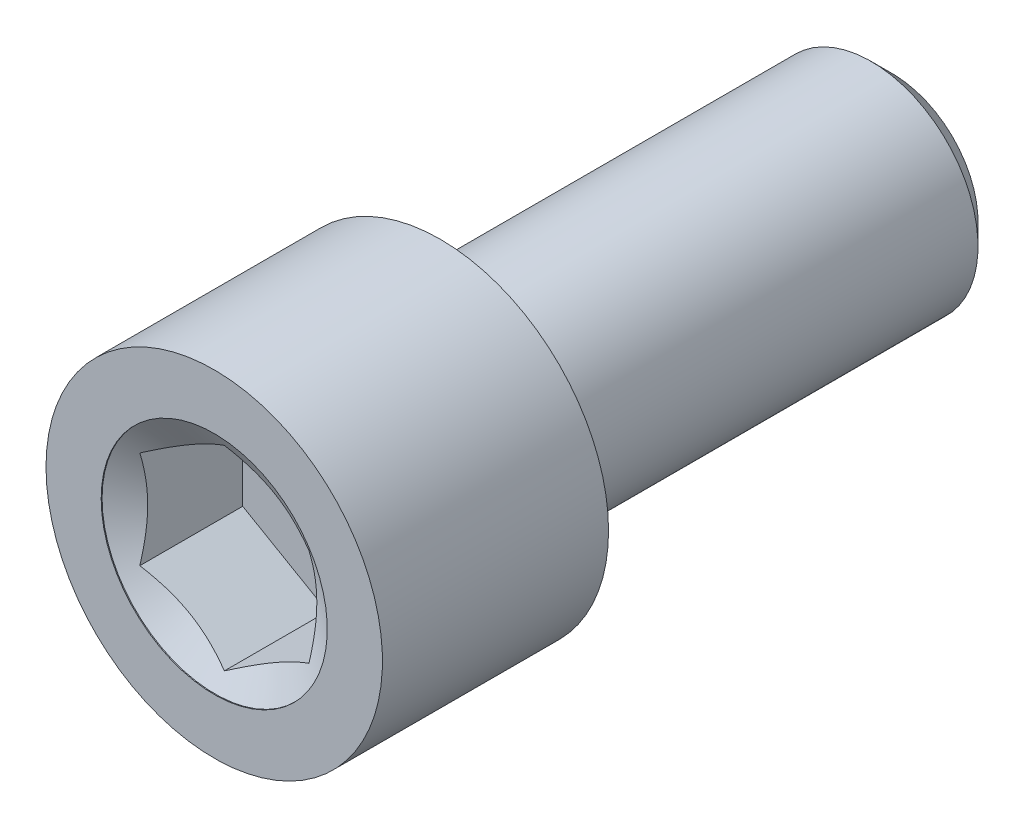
ISO-10303-21;
HEADER;
FILE_DESCRIPTION(('STEP AP214'),'2;1');
FILE_NAME('part.step','',(''),(''),'','','');
FILE_SCHEMA(('AUTOMOTIVE_DESIGN { 1 0 10303 214 1 1 1 1 }'));
ENDSEC;
DATA;
#1=APPLICATION_CONTEXT('core data for automotive mechanical design processes');
#2=APPLICATION_PROTOCOL_DEFINITION('international standard','automotive_design',2000,#1);
#3=PRODUCT_CONTEXT('',#1,'mechanical');
#4=PRODUCT('Part','Part','',(#3));
#5=PRODUCT_RELATED_PRODUCT_CATEGORY('part','',(#4));
#6=PRODUCT_DEFINITION_FORMATION('','',#4);
#7=PRODUCT_DEFINITION_CONTEXT('part definition',#1,'design');
#8=PRODUCT_DEFINITION('design','',#6,#7);
#9=PRODUCT_DEFINITION_SHAPE('','',#8);
#10=(LENGTH_UNIT() NAMED_UNIT(*) SI_UNIT(.MILLI.,.METRE.));
#11=(NAMED_UNIT(*) PLANE_ANGLE_UNIT() SI_UNIT($,.RADIAN.));
#12=(NAMED_UNIT(*) SI_UNIT($,.STERADIAN.) SOLID_ANGLE_UNIT());
#13=UNCERTAINTY_MEASURE_WITH_UNIT(LENGTH_MEASURE(1.E-05),#10,'distance_accuracy_value','');
#14=(GEOMETRIC_REPRESENTATION_CONTEXT(3) GLOBAL_UNCERTAINTY_ASSIGNED_CONTEXT((#13)) GLOBAL_UNIT_ASSIGNED_CONTEXT((#10,
#11,#12)) REPRESENTATION_CONTEXT('',''));
#15=CARTESIAN_POINT('',(0.,0.,0.));
#16=DIRECTION('',(0.,0.,1.));
#17=DIRECTION('',(1.,0.,0.));
#18=AXIS2_PLACEMENT_3D('',#15,#16,#17);
#19=CARTESIAN_POINT('',(0.,0.,0.));
#20=DIRECTION('',(0.,0.,-1.));
#21=DIRECTION('',(-1.,0.,0.));
#22=AXIS2_PLACEMENT_3D('',#19,#20,#21);
#23=PLANE('',#22);
#24=CARTESIAN_POINT('',(0.,0.,0.));
#25=DIRECTION('',(0.,0.,1.));
#26=DIRECTION('',(1.,0.,0.));
#27=AXIS2_PLACEMENT_3D('',#24,#25,#26);
#28=CIRCLE('',#27,4.7244);
#29=CARTESIAN_POINT('',(4.7244,0.,0.));
#30=VERTEX_POINT('',#29);
#31=EDGE_CURVE('E72',#30,#30,#28,.T.);
#32=ORIENTED_EDGE('',*,*,#31,.F.);
#33=EDGE_LOOP('',(#32));
#34=FACE_BOUND('',#33,.T.);
#35=CARTESIAN_POINT('',(0.,0.,0.));
#36=DIRECTION('',(0.,0.,-1.));
#37=DIRECTION('',(-1.,0.,0.));
#38=AXIS2_PLACEMENT_3D('',#35,#36,#37);
#39=CIRCLE('',#38,3.);
#40=CARTESIAN_POINT('',(-3.,0.,0.));
#41=VERTEX_POINT('',#40);
#42=EDGE_CURVE('E193',#41,#41,#39,.T.);
#43=ORIENTED_EDGE('',*,*,#42,.F.);
#44=EDGE_LOOP('',(#43));
#45=FACE_BOUND('',#44,.T.);
#46=ADVANCED_FACE('F14',(#34,#45),#23,.T.);
#47=CARTESIAN_POINT('',(0.,0.,6.35));
#48=DIRECTION('',(0.,0.,1.));
#49=DIRECTION('',(1.,0.,0.));
#50=AXIS2_PLACEMENT_3D('',#47,#48,#49);
#51=PLANE('',#50);
#52=CARTESIAN_POINT('',(0.,0.,6.35));
#53=DIRECTION('',(0.,0.,-1.));
#54=DIRECTION('',(-1.,0.,0.));
#55=AXIS2_PLACEMENT_3D('',#52,#53,#54);
#56=CIRCLE('',#55,3.175);
#57=CARTESIAN_POINT('',(-3.175,0.,6.35));
#58=VERTEX_POINT('',#57);
#59=EDGE_CURVE('E195',#58,#58,#56,.T.);
#60=ORIENTED_EDGE('',*,*,#59,.T.);
#61=EDGE_LOOP('',(#60));
#62=FACE_BOUND('',#61,.T.);
#63=CARTESIAN_POINT('',(0.,0.,6.35));
#64=DIRECTION('',(0.,0.,-1.));
#65=DIRECTION('',(-1.,0.,0.));
#66=AXIS2_PLACEMENT_3D('',#63,#64,#65);
#67=CIRCLE('',#66,4.7244);
#68=CARTESIAN_POINT('',(-4.7244,0.,6.35));
#69=VERTEX_POINT('',#68);
#70=EDGE_CURVE('E99',#69,#69,#67,.T.);
#71=ORIENTED_EDGE('',*,*,#70,.F.);
#72=EDGE_LOOP('',(#71));
#73=FACE_BOUND('',#72,.T.);
#74=ADVANCED_FACE('F174',(#62,#73),#51,.T.);
#75=CARTESIAN_POINT('',(0.,0.,6.35));
#76=DIRECTION('',(0.,0.,-1.));
#77=DIRECTION('',(-1.,0.,0.));
#78=AXIS2_PLACEMENT_3D('',#75,#76,#77);
#79=CYLINDRICAL_SURFACE('',#78,4.7244);
#80=ORIENTED_EDGE('',*,*,#31,.T.);
#81=EDGE_LOOP('',(#80));
#82=FACE_BOUND('',#81,.T.);
#83=ORIENTED_EDGE('',*,*,#70,.T.);
#84=EDGE_LOOP('',(#83));
#85=FACE_BOUND('',#84,.T.);
#86=ADVANCED_FACE('F118',(#82,#85),#79,.T.);
#87=CARTESIAN_POINT('',(0.,0.,6.3246));
#88=DIRECTION('',(0.,0.,1.));
#89=DIRECTION('',(1.,0.,0.));
#90=AXIS2_PLACEMENT_3D('',#87,#88,#89);
#91=CONICAL_SURFACE('',#90,3.175,1.02974425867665);
#92=CARTESIAN_POINT('',(0.,0.,6.3246));
#93=DIRECTION('',(0.,0.,-1.));
#94=DIRECTION('',(-1.,0.,0.));
#95=AXIS2_PLACEMENT_3D('',#92,#93,#94);
#96=CIRCLE('',#95,3.175);
#97=CARTESIAN_POINT('',(-3.175,0.,6.3246));
#98=VERTEX_POINT('',#97);
#99=EDGE_CURVE('E78',#98,#98,#96,.T.);
#100=ORIENTED_EDGE('',*,*,#99,.F.);
#101=EDGE_LOOP('',(#100));
#102=FACE_BOUND('',#101,.T.);
#103=CARTESIAN_POINT('',(0.000200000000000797,2.74241377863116,6.06467597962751));
#104=CARTESIAN_POINT('',(-0.104543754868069,2.68193994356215,6.02832546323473));
#105=CARTESIAN_POINT('',(-0.210266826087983,2.62090069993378,5.99525073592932));
#106=CARTESIAN_POINT('',(-0.423702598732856,2.49767349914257,5.93753440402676));
#107=CARTESIAN_POINT('',(-0.531419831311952,2.43548292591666,5.91291538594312));
#108=CARTESIAN_POINT('',(-0.745407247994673,2.3119372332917,5.87472488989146));
#109=CARTESIAN_POINT('',(-0.851638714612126,2.25060446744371,5.86087472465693));
#110=CARTESIAN_POINT('',(-1.06463129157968,2.1276331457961,5.84451243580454));
#111=CARTESIAN_POINT('',(-1.1713914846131,2.06599511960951,5.84198491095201));
#112=CARTESIAN_POINT('',(-1.36993198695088,1.95136770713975,5.84803528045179));
#113=CARTESIAN_POINT('',(-1.46174929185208,1.89835696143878,5.85513085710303));
#114=CARTESIAN_POINT('',(-1.64473330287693,1.79271109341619,5.87735770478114));
#115=CARTESIAN_POINT('',(-1.73589925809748,1.74007640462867,5.89249708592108));
#116=CARTESIAN_POINT('',(-1.91928064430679,1.63420111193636,5.93024522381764));
#117=CARTESIAN_POINT('',(-2.01146917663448,1.58097603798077,5.95302365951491));
#118=CARTESIAN_POINT('',(-2.19436836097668,1.47537914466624,6.00463057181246));
#119=CARTESIAN_POINT('',(-2.28508175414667,1.42300574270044,6.03344599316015));
#120=CARTESIAN_POINT('',(-2.3751,1.37103368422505,6.06467597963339));
#121=B_SPLINE_CURVE_WITH_KNOTS('',3,(#103,#104,#105,#106,#107,#108,#109,#110,#111,#112,#113,
#114,#115,#116,#117,#118,#119,#120),.UNSPECIFIED.,.F.,.F.,(4,2,2,2,2,2,2,2,4),(0.,
0.379043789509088,0.759092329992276,1.12894402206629,1.49829248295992,1.81674523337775,
2.13551967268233,2.46190377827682,2.78758921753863),.UNSPECIFIED.);
#122=CARTESIAN_POINT('',(0.,2.74229830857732,6.0646065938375));
#123=VERTEX_POINT('',#122);
#124=CARTESIAN_POINT('',(-2.3749,1.37114915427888,6.06460659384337));
#125=VERTEX_POINT('',#124);
#126=EDGE_CURVE('E66',#123,#125,#121,.T.);
#127=ORIENTED_EDGE('',*,*,#126,.F.);
#128=CARTESIAN_POINT('',(2.3751,1.37103368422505,6.06467597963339));
#129=CARTESIAN_POINT('',(2.27035624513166,1.43150751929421,6.02832546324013));
#130=CARTESIAN_POINT('',(2.16463317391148,1.49254676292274,5.99525073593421));
#131=CARTESIAN_POINT('',(1.95119740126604,1.61577396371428,5.93753440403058));
#132=CARTESIAN_POINT('',(1.84348016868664,1.67796453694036,5.9129153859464));
#133=CARTESIAN_POINT('',(1.62949275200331,1.80151022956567,5.87472488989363));
#134=CARTESIAN_POINT('',(1.52326128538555,1.86284299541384,5.86087472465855));
#135=CARTESIAN_POINT('',(1.31026870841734,1.98581431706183,5.84451243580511));
#136=CARTESIAN_POINT('',(1.20350851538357,2.04745234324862,5.84198491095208));
#137=CARTESIAN_POINT('',(1.00496801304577,2.16207975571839,5.84803528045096));
#138=CARTESIAN_POINT('',(0.913150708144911,2.21509050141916,5.85513085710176));
#139=CARTESIAN_POINT('',(0.730166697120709,2.32073636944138,5.87735770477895));
#140=CARTESIAN_POINT('',(0.639000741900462,2.37337105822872,5.89249708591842));
#141=CARTESIAN_POINT('',(0.455619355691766,2.47924635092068,5.93024522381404));
#142=CARTESIAN_POINT('',(0.363430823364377,2.5324714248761,5.95302365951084));
#143=CARTESIAN_POINT('',(0.180531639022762,2.63806831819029,6.00463057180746));
#144=CARTESIAN_POINT('',(0.08981824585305,2.69044172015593,6.0334459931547));
#145=CARTESIAN_POINT('',(-0.000199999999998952,2.74241377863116,6.06467597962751));
#146=B_SPLINE_CURVE_WITH_KNOTS('',3,(#128,#129,#130,#131,#132,#133,#134,#135,#136,#137,#138,
#139,#140,#141,#142,#143,#144,#145),.UNSPECIFIED.,.F.,.F.,(4,2,2,2,2,2,2,2,4),(0.,
0.379043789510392,0.759092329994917,1.12894402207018,1.49829248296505,1.81674523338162,
2.13551967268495,2.46190377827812,2.78758921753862),.UNSPECIFIED.);
#147=CARTESIAN_POINT('',(2.3749,1.37114915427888,6.06460659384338));
#148=VERTEX_POINT('',#147);
#149=EDGE_CURVE('E68',#148,#123,#146,.T.);
#150=ORIENTED_EDGE('',*,*,#149,.F.);
#151=CARTESIAN_POINT('',(2.3749,-3.57314083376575,6.99479666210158));
#152=CARTESIAN_POINT('',(2.3749,-3.47162294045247,6.94401053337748));
#153=CARTESIAN_POINT('',(2.3749,-3.36984710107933,6.89373075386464));
#154=CARTESIAN_POINT('',(2.3749,-3.16564311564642,6.79446849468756));
#155=CARTESIAN_POINT('',(2.3749,-3.06321485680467,6.74548624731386));
#156=CARTESIAN_POINT('',(2.3749,-2.85697756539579,6.64882756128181));
#157=CARTESIAN_POINT('',(2.3749,-2.75316392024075,6.60116092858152));
#158=CARTESIAN_POINT('',(2.3749,-2.54462830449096,6.50786539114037));
#159=CARTESIAN_POINT('',(2.3749,-2.43990638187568,6.46223637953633));
#160=CARTESIAN_POINT('',(2.3749,-2.22618028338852,6.37220897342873));
#161=CARTESIAN_POINT('',(2.3749,-2.11714253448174,6.32788982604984));
#162=CARTESIAN_POINT('',(2.3749,-1.89767917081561,6.24276324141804));
#163=CARTESIAN_POINT('',(2.3749,-1.78725338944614,6.20195623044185));
#164=CARTESIAN_POINT('',(2.3749,-1.56506657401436,6.12497852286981));
#165=CARTESIAN_POINT('',(2.3749,-1.45330921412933,6.08879733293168));
#166=CARTESIAN_POINT('',(2.3749,-1.22808764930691,6.02227243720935));
#167=CARTESIAN_POINT('',(2.3749,-1.11462404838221,5.99192671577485));
#168=CARTESIAN_POINT('',(2.3749,-0.884973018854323,5.93836837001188));
#169=CARTESIAN_POINT('',(2.3749,-0.76877063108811,5.91521861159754));
#170=CARTESIAN_POINT('',(2.3749,-0.534894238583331,5.87803054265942));
#171=CARTESIAN_POINT('',(2.3749,-0.417220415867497,5.8639911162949));
#172=CARTESIAN_POINT('',(2.3749,-0.182643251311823,5.84638156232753));
#173=CARTESIAN_POINT('',(2.3749,-0.0657504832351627,5.8426746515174));
#174=CARTESIAN_POINT('',(2.3749,0.167900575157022,5.84568811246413));
#175=CARTESIAN_POINT('',(2.3749,0.28465885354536,5.85240934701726));
#176=CARTESIAN_POINT('',(2.3749,0.561013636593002,5.88006074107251));
#177=CARTESIAN_POINT('',(2.3749,0.720167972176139,5.90539186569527));
#178=CARTESIAN_POINT('',(2.3749,1.03540167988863,5.97101407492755));
#179=CARTESIAN_POINT('',(2.3749,1.19147743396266,6.01132177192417));
#180=CARTESIAN_POINT('',(2.3749,1.42492676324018,6.08048740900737));
#181=CARTESIAN_POINT('',(2.3749,1.50353490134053,6.10533243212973));
#182=CARTESIAN_POINT('',(2.3749,1.65990539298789,6.15741445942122));
#183=CARTESIAN_POINT('',(2.3749,1.73766822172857,6.1846500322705));
#184=CARTESIAN_POINT('',(2.3749,1.89244761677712,6.24112314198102));
#185=CARTESIAN_POINT('',(2.3749,1.96946427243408,6.27036043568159));
#186=CARTESIAN_POINT('',(2.3749,2.12284910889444,6.33051813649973));
#187=CARTESIAN_POINT('',(2.3749,2.19921718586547,6.36143880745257));
#188=CARTESIAN_POINT('',(2.3749,2.40628847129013,6.44750985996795));
#189=CARTESIAN_POINT('',(2.3749,2.5364186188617,6.50403798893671));
#190=CARTESIAN_POINT('',(2.3749,2.79529644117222,6.62018630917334));
#191=CARTESIAN_POINT('',(2.3749,2.92404396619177,6.67980683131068));
#192=CARTESIAN_POINT('',(2.3749,3.18046081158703,6.80140465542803));
#193=CARTESIAN_POINT('',(2.3749,3.3081298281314,6.86338259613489));
#194=CARTESIAN_POINT('',(2.3749,3.56257581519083,6.98914653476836));
#195=CARTESIAN_POINT('',(2.3749,3.68935275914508,7.05293258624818));
#196=CARTESIAN_POINT('',(2.3749,4.06900823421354,7.24659148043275));
#197=CARTESIAN_POINT('',(2.3749,4.32081052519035,7.37857164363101));
#198=CARTESIAN_POINT('',(2.3749,4.82245621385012,7.64606708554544));
#199=CARTESIAN_POINT('',(2.3749,5.07229996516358,7.78158170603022));
#200=CARTESIAN_POINT('',(2.3749,5.54404395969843,8.0404293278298));
#201=CARTESIAN_POINT('',(2.3749,5.76607872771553,8.16351757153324));
#202=CARTESIAN_POINT('',(2.3749,6.20937082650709,8.41111192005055));
#203=CARTESIAN_POINT('',(2.3749,6.43062811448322,8.53561810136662));
#204=CARTESIAN_POINT('',(2.37489999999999,6.87182116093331,8.78527601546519));
#205=CARTESIAN_POINT('',(2.37489999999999,7.09175887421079,8.9104242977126));
#206=CARTESIAN_POINT('',(2.37489999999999,7.53115018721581,9.16153193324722));
#207=CARTESIAN_POINT('',(2.3749,7.75060382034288,9.28749122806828));
#208=CARTESIAN_POINT('',(2.3749,7.96988594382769,9.41374640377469));
#209=B_SPLINE_CURVE_WITH_KNOTS('',3,(#151,#152,#153,#154,#155,#156,#157,#158,#159,#160,#161,
#162,#163,#164,#165,#166,#167,#168,#169,#170,#171,#172,#173,#174,#175,#176,#177,#178,#179,#180,
#181,#182,#183,#184,#185,#186,#187,#188,#189,#190,#191,#192,#193,#194,#195,#196,#197,#198,#199,
#200,#201,#202,#203,#204,#205,#206,#207,#208),.UNSPECIFIED.,.F.,.F.,(4,2,2,2,2,2,2,2,2,2,2,2,2,
2,2,2,2,2,2,2,2,2,2,2,2,2,2,2,4),(0.,0.340542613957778,0.681145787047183,1.02382984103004,
1.36649590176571,1.71955056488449,2.07264801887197,2.42492972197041,2.77708952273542,
3.13224462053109,3.48735621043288,3.83774393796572,4.18816065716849,4.67066465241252,
5.1537054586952,5.40099876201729,5.6481449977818,5.89526126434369,6.14241637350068,
6.5679890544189,6.99360736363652,7.41934182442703,7.84508890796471,8.69791803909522,
9.55058946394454,10.3121934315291,11.073838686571,11.8329890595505,12.5920853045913),.UNSPECIFIED.);
#210=CARTESIAN_POINT('',(2.3749,-1.371149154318,6.06460659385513));
#211=VERTEX_POINT('',#210);
#212=EDGE_CURVE('E77',#211,#148,#209,.T.);
#213=ORIENTED_EDGE('',*,*,#212,.F.);
#214=CARTESIAN_POINT('',(-0.000199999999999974,-2.74241377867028,6.06467597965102));
#215=CARTESIAN_POINT('',(0.104543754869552,-2.68193994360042,6.02832546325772));
#216=CARTESIAN_POINT('',(0.210266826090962,-2.62090069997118,5.99525073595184));
#217=CARTESIAN_POINT('',(0.423702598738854,-2.49767349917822,5.93753440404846));
#218=CARTESIAN_POINT('',(0.531419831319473,-2.43548292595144,5.91291538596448));
#219=CARTESIAN_POINT('',(0.745407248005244,-2.31193723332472,5.87472488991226));
#220=CARTESIAN_POINT('',(0.851638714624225,-2.25060446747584,5.86087472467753));
#221=CARTESIAN_POINT('',(1.06463129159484,-2.12763314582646,5.84451243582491));
#222=CARTESIAN_POINT('',(1.1713914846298,-2.06599511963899,5.84198491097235));
#223=CARTESIAN_POINT('',(1.36993198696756,-1.95136770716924,5.84803528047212));
#224=CARTESIAN_POINT('',(1.46174929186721,-1.89835696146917,5.85513085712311));
#225=CARTESIAN_POINT('',(1.644733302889,-1.79271109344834,5.87735770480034));
#226=CARTESIAN_POINT('',(1.73589925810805,-1.74007640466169,5.89249708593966));
#227=CARTESIAN_POINT('',(1.91928064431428,-1.63420111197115,5.93024522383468));
#228=CARTESIAN_POINT('',(2.01146917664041,-1.58097603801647,5.95302365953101));
#229=CARTESIAN_POINT('',(2.19436836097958,-1.47537914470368,6.0046305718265));
#230=CARTESIAN_POINT('',(2.28508175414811,-1.42300574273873,6.03344599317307));
#231=CARTESIAN_POINT('',(2.3751,-1.37103368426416,6.06467597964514));
#232=B_SPLINE_CURVE_WITH_KNOTS('',3,(#214,#215,#216,#217,#218,#219,#220,#221,#222,#223,#224,
#225,#226,#227,#228,#229,#230,#231),.UNSPECIFIED.,.F.,.F.,(4,2,2,2,2,2,2,2,4),(0.,
0.379043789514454,0.759092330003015,1.12894402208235,1.49829248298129,1.81674523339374,
2.13551967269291,2.46190377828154,2.78758921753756),.UNSPECIFIED.);
#233=CARTESIAN_POINT('',(0.,-2.74229830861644,6.06460659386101));
#234=VERTEX_POINT('',#233);
#235=EDGE_CURVE('E139',#234,#211,#232,.T.);
#236=ORIENTED_EDGE('',*,*,#235,.F.);
#237=CARTESIAN_POINT('',(-2.3751,-1.37103368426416,6.06467597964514));
#238=CARTESIAN_POINT('',(-2.27035624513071,-1.43150751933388,6.02832546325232));
#239=CARTESIAN_POINT('',(-2.16463317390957,-1.49254676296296,5.99525073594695));
#240=CARTESIAN_POINT('',(-1.95119740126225,-1.61577396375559,5.93753440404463));
#241=CARTESIAN_POINT('',(-1.84348016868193,-1.6779645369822,5.9129153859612));
#242=CARTESIAN_POINT('',(-1.62949275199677,-1.80151022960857,5.87472488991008));
#243=CARTESIAN_POINT('',(-1.5232612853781,-1.86284299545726,5.86087472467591));
#244=CARTESIAN_POINT('',(-1.31026870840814,-1.98581431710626,5.84451243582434));
#245=CARTESIAN_POINT('',(-1.20350851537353,-2.04745234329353,5.84198491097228));
#246=CARTESIAN_POINT('',(-1.00496801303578,-2.16207975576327,5.84803528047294));
#247=CARTESIAN_POINT('',(-0.913150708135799,-2.21509050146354,5.85513085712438));
#248=CARTESIAN_POINT('',(-0.730166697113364,-2.32073636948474,5.87735770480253));
#249=CARTESIAN_POINT('',(-0.639000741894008,-2.37337105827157,5.89249708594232));
#250=CARTESIAN_POINT('',(-0.455619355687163,-2.47924635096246,5.93024522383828));
#251=CARTESIAN_POINT('',(-0.363430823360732,-2.53247142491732,5.95302365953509));
#252=CARTESIAN_POINT('',(-0.180531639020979,-2.63806831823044,6.0046305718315));
#253=CARTESIAN_POINT('',(-0.0898182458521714,-2.69044172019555,6.03344599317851));
#254=CARTESIAN_POINT('',(0.000199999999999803,-2.74241377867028,6.06467597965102));
#255=B_SPLINE_CURVE_WITH_KNOTS('',3,(#237,#238,#239,#240,#241,#242,#243,#244,#245,#246,#247,
#248,#249,#250,#251,#252,#253,#254),.UNSPECIFIED.,.F.,.F.,(4,2,2,2,2,2,2,2,4),(0.,
0.379043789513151,0.759092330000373,1.12894402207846,1.49829248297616,1.81674523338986,
2.13551967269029,2.46190377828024,2.78758921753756),.UNSPECIFIED.);
#256=CARTESIAN_POINT('',(-2.3749,-1.371149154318,6.06460659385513));
#257=VERTEX_POINT('',#256);
#258=EDGE_CURVE('E146',#257,#234,#255,.T.);
#259=ORIENTED_EDGE('',*,*,#258,.F.);
#260=CARTESIAN_POINT('',(-2.3749,-3.57314083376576,6.99479666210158));
#261=CARTESIAN_POINT('',(-2.3749,-3.47162294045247,6.94401053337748));
#262=CARTESIAN_POINT('',(-2.3749,-3.36984710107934,6.89373075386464));
#263=CARTESIAN_POINT('',(-2.3749,-3.16564311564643,6.79446849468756));
#264=CARTESIAN_POINT('',(-2.3749,-3.06321485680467,6.74548624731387));
#265=CARTESIAN_POINT('',(-2.3749,-2.85697756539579,6.64882756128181));
#266=CARTESIAN_POINT('',(-2.3749,-2.75316392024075,6.60116092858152));
#267=CARTESIAN_POINT('',(-2.3749,-2.54462830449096,6.50786539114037));
#268=CARTESIAN_POINT('',(-2.3749,-2.43990638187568,6.46223637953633));
#269=CARTESIAN_POINT('',(-2.3749,-2.22618028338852,6.37220897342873));
#270=CARTESIAN_POINT('',(-2.3749,-2.11714253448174,6.32788982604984));
#271=CARTESIAN_POINT('',(-2.3749,-1.89767917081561,6.24276324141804));
#272=CARTESIAN_POINT('',(-2.3749,-1.78725338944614,6.20195623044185));
#273=CARTESIAN_POINT('',(-2.3749,-1.56506657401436,6.12497852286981));
#274=CARTESIAN_POINT('',(-2.3749,-1.45330921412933,6.08879733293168));
#275=CARTESIAN_POINT('',(-2.3749,-1.22808764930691,6.02227243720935));
#276=CARTESIAN_POINT('',(-2.3749,-1.11462404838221,5.99192671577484));
#277=CARTESIAN_POINT('',(-2.3749,-0.884973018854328,5.93836837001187));
#278=CARTESIAN_POINT('',(-2.3749,-0.768770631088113,5.91521861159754));
#279=CARTESIAN_POINT('',(-2.3749,-0.534894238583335,5.87803054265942));
#280=CARTESIAN_POINT('',(-2.3749,-0.417220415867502,5.8639911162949));
#281=CARTESIAN_POINT('',(-2.3749,-0.182643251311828,5.84638156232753));
#282=CARTESIAN_POINT('',(-2.3749,-0.0657504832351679,5.8426746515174));
#283=CARTESIAN_POINT('',(-2.3749,0.167900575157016,5.84568811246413));
#284=CARTESIAN_POINT('',(-2.3749,0.284658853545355,5.85240934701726));
#285=CARTESIAN_POINT('',(-2.3749,0.561013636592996,5.88006074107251));
#286=CARTESIAN_POINT('',(-2.3749,0.720167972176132,5.90539186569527));
#287=CARTESIAN_POINT('',(-2.3749,1.03540167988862,5.97101407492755));
#288=CARTESIAN_POINT('',(-2.3749,1.19147743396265,6.01132177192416));
#289=CARTESIAN_POINT('',(-2.3749,1.42492676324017,6.08048740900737));
#290=CARTESIAN_POINT('',(-2.3749,1.50353490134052,6.10533243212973));
#291=CARTESIAN_POINT('',(-2.3749,1.65990539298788,6.15741445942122));
#292=CARTESIAN_POINT('',(-2.3749,1.73766822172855,6.1846500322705));
#293=CARTESIAN_POINT('',(-2.3749,1.8924476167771,6.24112314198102));
#294=CARTESIAN_POINT('',(-2.3749,1.96946427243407,6.27036043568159));
#295=CARTESIAN_POINT('',(-2.3749,2.12284910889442,6.33051813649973));
#296=CARTESIAN_POINT('',(-2.3749,2.19921718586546,6.36143880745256));
#297=CARTESIAN_POINT('',(-2.3749,2.40628847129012,6.44750985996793));
#298=CARTESIAN_POINT('',(-2.3749,2.53641861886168,6.5040379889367));
#299=CARTESIAN_POINT('',(-2.3749,2.7952964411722,6.62018630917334));
#300=CARTESIAN_POINT('',(-2.3749,2.92404396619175,6.67980683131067));
#301=CARTESIAN_POINT('',(-2.3749,3.18046081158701,6.80140465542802));
#302=CARTESIAN_POINT('',(-2.3749,3.30812982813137,6.86338259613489));
#303=CARTESIAN_POINT('',(-2.3749,3.5625758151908,6.98914653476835));
#304=CARTESIAN_POINT('',(-2.3749,3.68935275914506,7.05293258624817));
#305=CARTESIAN_POINT('',(-2.3749,4.06900823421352,7.24659148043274));
#306=CARTESIAN_POINT('',(-2.3749,4.32081052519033,7.378571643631));
#307=CARTESIAN_POINT('',(-2.3749,4.82245621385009,7.64606708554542));
#308=CARTESIAN_POINT('',(-2.3749,5.07229996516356,7.7815817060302));
#309=CARTESIAN_POINT('',(-2.3749,5.54404395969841,8.04042932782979));
#310=CARTESIAN_POINT('',(-2.3749,5.76607872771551,8.16351757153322));
#311=CARTESIAN_POINT('',(-2.3749,6.20937082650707,8.41111192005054));
#312=CARTESIAN_POINT('',(-2.3749,6.43062811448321,8.53561810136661));
#313=CARTESIAN_POINT('',(-2.3749,6.8718211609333,8.78527601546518));
#314=CARTESIAN_POINT('',(-2.3749,7.09175887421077,8.91042429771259));
#315=CARTESIAN_POINT('',(-2.3749,7.5311501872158,9.16153193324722));
#316=CARTESIAN_POINT('',(-2.3749,7.75060382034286,9.28749122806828));
#317=CARTESIAN_POINT('',(-2.3749,7.96988594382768,9.41374640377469));
#318=B_SPLINE_CURVE_WITH_KNOTS('',3,(#260,#261,#262,#263,#264,#265,#266,#267,#268,#269,#270,
#271,#272,#273,#274,#275,#276,#277,#278,#279,#280,#281,#282,#283,#284,#285,#286,#287,#288,#289,
#290,#291,#292,#293,#294,#295,#296,#297,#298,#299,#300,#301,#302,#303,#304,#305,#306,#307,#308,
#309,#310,#311,#312,#313,#314,#315,#316,#317),.UNSPECIFIED.,.F.,.F.,(4,2,2,2,2,2,2,2,2,2,2,2,2,
2,2,2,2,2,2,2,2,2,2,2,2,2,2,2,4),(0.,0.34054261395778,0.681145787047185,1.02382984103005,
1.36649590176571,1.71955056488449,2.07264801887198,2.42492972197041,2.77708952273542,
3.13224462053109,3.48735621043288,3.83774393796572,4.18816065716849,4.67066465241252,
5.1537054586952,5.40099876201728,5.64814499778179,5.89526126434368,6.14241637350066,
6.56798905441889,6.9936073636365,7.41934182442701,7.84508890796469,8.6979180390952,
9.55058946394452,10.3121934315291,11.073838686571,11.8329890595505,12.5920853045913),.UNSPECIFIED.);
#319=EDGE_CURVE('E29',#125,#257,#318,.F.);
#320=ORIENTED_EDGE('',*,*,#319,.F.);
#321=EDGE_LOOP('',(#127,#150,#213,#236,#259,#320));
#322=FACE_BOUND('',#321,.T.);
#323=ADVANCED_FACE('F67',(#102,#322),#91,.F.);
#324=CARTESIAN_POINT('',(0.,0.,6.35));
#325=DIRECTION('',(0.,0.,-1.));
#326=DIRECTION('',(-1.,0.,0.));
#327=AXIS2_PLACEMENT_3D('',#324,#325,#326);
#328=CYLINDRICAL_SURFACE('',#327,3.175);
#329=ORIENTED_EDGE('',*,*,#99,.T.);
#330=EDGE_LOOP('',(#329));
#331=FACE_BOUND('',#330,.T.);
#332=ORIENTED_EDGE('',*,*,#59,.F.);
#333=EDGE_LOOP('',(#332));
#334=FACE_BOUND('',#333,.T.);
#335=ADVANCED_FACE('F117',(#331,#334),#328,.F.);
#336=CARTESIAN_POINT('',(-2.3749,4.11344746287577,3.175));
#337=DIRECTION('',(0.,0.,-1.));
#338=DIRECTION('',(-1.,0.,0.));
#339=AXIS2_PLACEMENT_3D('',#336,#337,#338);
#340=PLANE('',#339);
#341=DIRECTION('',(0.,-1.,0.));
#342=VECTOR('',#341,1.);
#343=CARTESIAN_POINT('',(-2.3749,1.37114915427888,3.175));
#344=LINE('',#343,#342);
#345=CARTESIAN_POINT('',(-2.3749,1.37114915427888,3.175));
#346=VERTEX_POINT('',#345);
#347=CARTESIAN_POINT('',(-2.3749,-1.371149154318,3.175));
#348=VERTEX_POINT('',#347);
#349=EDGE_CURVE('E218',#346,#348,#344,.T.);
#350=ORIENTED_EDGE('',*,*,#349,.T.);
#351=DIRECTION('',(0.866025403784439,-0.5,0.));
#352=VECTOR('',#351,1.);
#353=CARTESIAN_POINT('',(-2.3749,-1.371149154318,3.175));
#354=LINE('',#353,#352);
#355=CARTESIAN_POINT('',(0.,-2.74229830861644,3.175));
#356=VERTEX_POINT('',#355);
#357=EDGE_CURVE('E221',#348,#356,#354,.T.);
#358=ORIENTED_EDGE('',*,*,#357,.T.);
#359=DIRECTION('',(0.866025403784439,0.5,0.));
#360=VECTOR('',#359,1.);
#361=CARTESIAN_POINT('',(0.,-2.74229830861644,3.175));
#362=LINE('',#361,#360);
#363=CARTESIAN_POINT('',(2.3749,-1.371149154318,3.175));
#364=VERTEX_POINT('',#363);
#365=EDGE_CURVE('E223',#356,#364,#362,.T.);
#366=ORIENTED_EDGE('',*,*,#365,.T.);
#367=DIRECTION('',(0.,1.,0.));
#368=VECTOR('',#367,1.);
#369=CARTESIAN_POINT('',(2.3749,-1.371149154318,3.175));
#370=LINE('',#369,#368);
#371=CARTESIAN_POINT('',(2.3749,1.37114915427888,3.175));
#372=VERTEX_POINT('',#371);
#373=EDGE_CURVE('E227',#364,#372,#370,.T.);
#374=ORIENTED_EDGE('',*,*,#373,.T.);
#375=DIRECTION('',(-0.866025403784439,0.5,0.));
#376=VECTOR('',#375,1.);
#377=CARTESIAN_POINT('',(2.3749,1.37114915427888,3.175));
#378=LINE('',#377,#376);
#379=CARTESIAN_POINT('',(0.,2.74229830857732,3.175));
#380=VERTEX_POINT('',#379);
#381=EDGE_CURVE('E229',#372,#380,#378,.T.);
#382=ORIENTED_EDGE('',*,*,#381,.T.);
#383=DIRECTION('',(-0.866025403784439,-0.5,0.));
#384=VECTOR('',#383,1.);
#385=CARTESIAN_POINT('',(0.,2.74229830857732,3.175));
#386=LINE('',#385,#384);
#387=EDGE_CURVE('E83',#380,#346,#386,.T.);
#388=ORIENTED_EDGE('',*,*,#387,.T.);
#389=EDGE_LOOP('',(#350,#358,#366,#374,#382,#388));
#390=FACE_BOUND('',#389,.T.);
#391=ADVANCED_FACE('F204',(#390),#340,.F.);
#392=CARTESIAN_POINT('',(0.,2.74229830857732,3.175));
#393=DIRECTION('',(-0.5,0.866025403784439,0.));
#394=DIRECTION('',(0.866025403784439,0.5,0.));
#395=AXIS2_PLACEMENT_3D('',#392,#393,#394);
#396=PLANE('',#395);
#397=DIRECTION('',(0.,0.,1.));
#398=VECTOR('',#397,1.);
#399=CARTESIAN_POINT('',(0.,2.74229830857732,3.175));
#400=LINE('',#399,#398);
#401=EDGE_CURVE('E37',#380,#123,#400,.T.);
#402=ORIENTED_EDGE('',*,*,#401,.T.);
#403=ORIENTED_EDGE('',*,*,#126,.T.);
#404=DIRECTION('',(0.,0.,1.));
#405=VECTOR('',#404,1.);
#406=CARTESIAN_POINT('',(-2.3749,1.37114915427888,3.175));
#407=LINE('',#406,#405);
#408=EDGE_CURVE('E84',#346,#125,#407,.T.);
#409=ORIENTED_EDGE('',*,*,#408,.F.);
#410=ORIENTED_EDGE('',*,*,#387,.F.);
#411=EDGE_LOOP('',(#402,#403,#409,#410));
#412=FACE_BOUND('',#411,.T.);
#413=ADVANCED_FACE('F81',(#412),#396,.F.);
#414=CARTESIAN_POINT('',(2.3749,1.37114915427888,3.175));
#415=DIRECTION('',(0.5,0.866025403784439,0.));
#416=DIRECTION('',(0.866025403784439,-0.5,0.));
#417=AXIS2_PLACEMENT_3D('',#414,#415,#416);
#418=PLANE('',#417);
#419=DIRECTION('',(0.,0.,1.));
#420=VECTOR('',#419,1.);
#421=CARTESIAN_POINT('',(2.3749,1.37114915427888,3.175));
#422=LINE('',#421,#420);
#423=EDGE_CURVE('E76',#372,#148,#422,.T.);
#424=ORIENTED_EDGE('',*,*,#423,.T.);
#425=ORIENTED_EDGE('',*,*,#149,.T.);
#426=ORIENTED_EDGE('',*,*,#401,.F.);
#427=ORIENTED_EDGE('',*,*,#381,.F.);
#428=EDGE_LOOP('',(#424,#425,#426,#427));
#429=FACE_BOUND('',#428,.T.);
#430=ADVANCED_FACE('F75',(#429),#418,.F.);
#431=CARTESIAN_POINT('',(2.3749,-1.371149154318,3.175));
#432=DIRECTION('',(1.,0.,0.));
#433=DIRECTION('',(0.,-1.,0.));
#434=AXIS2_PLACEMENT_3D('',#431,#432,#433);
#435=PLANE('',#434);
#436=DIRECTION('',(0.,0.,1.));
#437=VECTOR('',#436,1.);
#438=CARTESIAN_POINT('',(2.3749,-1.371149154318,3.175));
#439=LINE('',#438,#437);
#440=EDGE_CURVE('E86',#364,#211,#439,.T.);
#441=ORIENTED_EDGE('',*,*,#440,.T.);
#442=ORIENTED_EDGE('',*,*,#212,.T.);
#443=ORIENTED_EDGE('',*,*,#423,.F.);
#444=ORIENTED_EDGE('',*,*,#373,.F.);
#445=EDGE_LOOP('',(#441,#442,#443,#444));
#446=FACE_BOUND('',#445,.T.);
#447=ADVANCED_FACE('F232',(#446),#435,.F.);
#448=CARTESIAN_POINT('',(0.,-2.74229830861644,3.175));
#449=DIRECTION('',(0.5,-0.866025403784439,0.));
#450=DIRECTION('',(-0.866025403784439,-0.5,0.));
#451=AXIS2_PLACEMENT_3D('',#448,#449,#450);
#452=PLANE('',#451);
#453=DIRECTION('',(0.,0.,1.));
#454=VECTOR('',#453,1.);
#455=CARTESIAN_POINT('',(0.,-2.74229830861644,3.175));
#456=LINE('',#455,#454);
#457=EDGE_CURVE('E94',#356,#234,#456,.T.);
#458=ORIENTED_EDGE('',*,*,#457,.T.);
#459=ORIENTED_EDGE('',*,*,#235,.T.);
#460=ORIENTED_EDGE('',*,*,#440,.F.);
#461=ORIENTED_EDGE('',*,*,#365,.F.);
#462=EDGE_LOOP('',(#458,#459,#460,#461));
#463=FACE_BOUND('',#462,.T.);
#464=ADVANCED_FACE('F163',(#463),#452,.F.);
#465=CARTESIAN_POINT('',(-2.3749,-1.371149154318,3.175));
#466=DIRECTION('',(-0.5,-0.866025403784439,0.));
#467=DIRECTION('',(-0.866025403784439,0.5,0.));
#468=AXIS2_PLACEMENT_3D('',#465,#466,#467);
#469=PLANE('',#468);
#470=DIRECTION('',(0.,0.,1.));
#471=VECTOR('',#470,1.);
#472=CARTESIAN_POINT('',(-2.3749,-1.371149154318,3.175));
#473=LINE('',#472,#471);
#474=EDGE_CURVE('E97',#348,#257,#473,.T.);
#475=ORIENTED_EDGE('',*,*,#474,.T.);
#476=ORIENTED_EDGE('',*,*,#258,.T.);
#477=ORIENTED_EDGE('',*,*,#457,.F.);
#478=ORIENTED_EDGE('',*,*,#357,.F.);
#479=EDGE_LOOP('',(#475,#476,#477,#478));
#480=FACE_BOUND('',#479,.T.);
#481=ADVANCED_FACE('F159',(#480),#469,.F.);
#482=CARTESIAN_POINT('',(-2.3749,1.37114915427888,3.175));
#483=DIRECTION('',(-1.,0.,0.));
#484=DIRECTION('',(0.,0.,1.));
#485=AXIS2_PLACEMENT_3D('',#482,#483,#484);
#486=PLANE('',#485);
#487=ORIENTED_EDGE('',*,*,#408,.T.);
#488=ORIENTED_EDGE('',*,*,#319,.T.);
#489=ORIENTED_EDGE('',*,*,#474,.F.);
#490=ORIENTED_EDGE('',*,*,#349,.F.);
#491=EDGE_LOOP('',(#487,#488,#489,#490));
#492=FACE_BOUND('',#491,.T.);
#493=ADVANCED_FACE('F162',(#492),#486,.F.);
#494=CARTESIAN_POINT('',(0.,0.,-20.));
#495=DIRECTION('',(0.,0.,1.));
#496=DIRECTION('',(1.,0.,0.));
#497=AXIS2_PLACEMENT_3D('',#494,#495,#496);
#498=CYLINDRICAL_SURFACE('',#497,3.);
#499=CARTESIAN_POINT('',(0.,0.,-12.1));
#500=DIRECTION('',(0.,0.,-1.));
#501=DIRECTION('',(-1.,0.,0.));
#502=AXIS2_PLACEMENT_3D('',#499,#500,#501);
#503=CIRCLE('',#502,3.);
#504=CARTESIAN_POINT('',(-3.,0.,-12.1));
#505=VERTEX_POINT('',#504);
#506=EDGE_CURVE('E9',#505,#505,#503,.F.);
#507=ORIENTED_EDGE('',*,*,#506,.T.);
#508=EDGE_LOOP('',(#507));
#509=FACE_BOUND('',#508,.T.);
#510=ORIENTED_EDGE('',*,*,#42,.T.);
#511=EDGE_LOOP('',(#510));
#512=FACE_BOUND('',#511,.T.);
#513=ADVANCED_FACE('F120',(#509,#512),#498,.T.);
#514=CARTESIAN_POINT('',(0.,0.,-12.7));
#515=DIRECTION('',(0.,0.,-1.));
#516=DIRECTION('',(-1.,0.,0.));
#517=AXIS2_PLACEMENT_3D('',#514,#515,#516);
#518=PLANE('',#517);
#519=CARTESIAN_POINT('',(0.,0.,-12.7));
#520=DIRECTION('',(0.,0.,-1.));
#521=DIRECTION('',(-1.,0.,0.));
#522=AXIS2_PLACEMENT_3D('',#519,#520,#521);
#523=CIRCLE('',#522,2.4);
#524=CARTESIAN_POINT('',(-2.4,0.,-12.7));
#525=VERTEX_POINT('',#524);
#526=EDGE_CURVE('E22',#525,#525,#523,.T.);
#527=ORIENTED_EDGE('',*,*,#526,.T.);
#528=EDGE_LOOP('',(#527));
#529=FACE_BOUND('',#528,.T.);
#530=ADVANCED_FACE('F170',(#529),#518,.T.);
#531=CARTESIAN_POINT('',(0.,0.,-12.7));
#532=DIRECTION('',(0.,0.,1.));
#533=DIRECTION('',(1.,0.,0.));
#534=AXIS2_PLACEMENT_3D('',#531,#532,#533);
#535=CONICAL_SURFACE('',#534,2.4,0.785398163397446);
#536=ORIENTED_EDGE('',*,*,#506,.F.);
#537=EDGE_LOOP('',(#536));
#538=FACE_BOUND('',#537,.T.);
#539=ORIENTED_EDGE('',*,*,#526,.F.);
#540=EDGE_LOOP('',(#539));
#541=FACE_BOUND('',#540,.T.);
#542=ADVANCED_FACE('F16',(#538,#541),#535,.T.);
#543=CLOSED_SHELL('',(#46,#74,#86,#323,#335,#391,#413,#430,#447,#464,#481,#493,#513,#530,#542));
#544=MANIFOLD_SOLID_BREP('B1',#543);
#545=ADVANCED_BREP_SHAPE_REPRESENTATION('',(#18,#544),#14);
#546=SHAPE_DEFINITION_REPRESENTATION(#9,#545);
ENDSEC;
END-ISO-10303-21;
